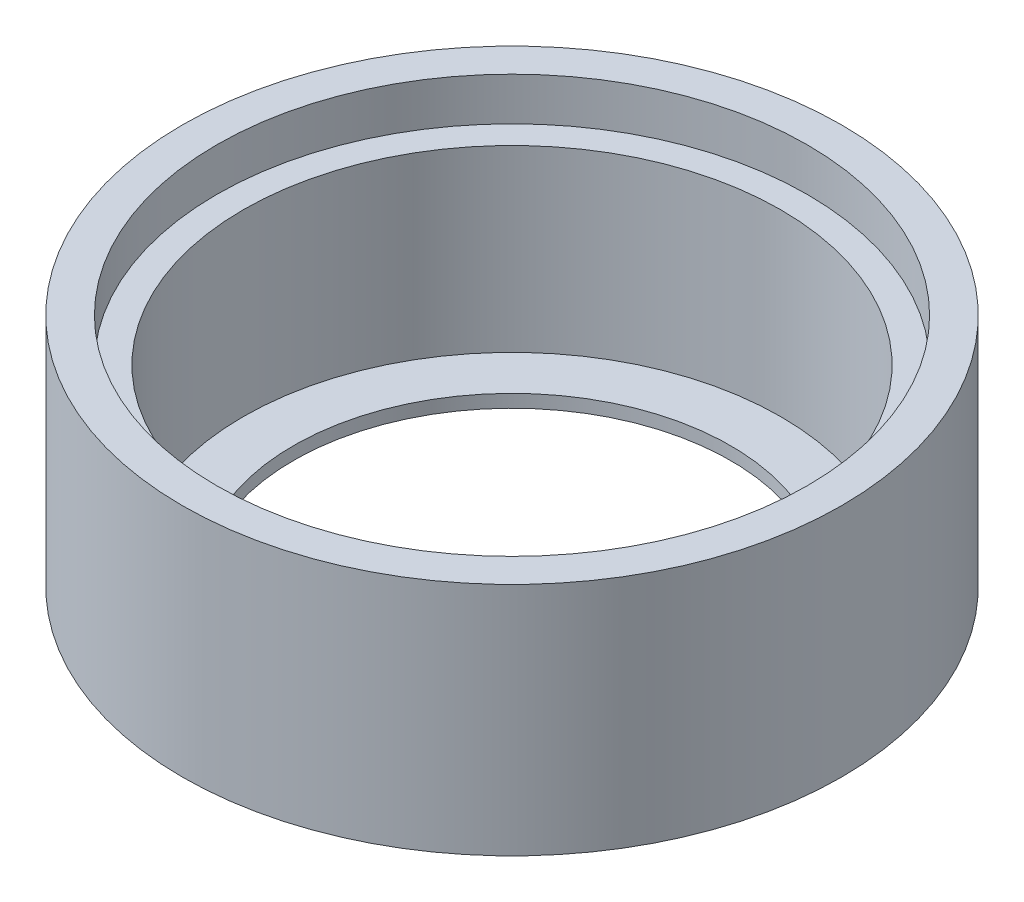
from build123d import *

# Parameters (mm, degrees)
SKETCH1_R           = 5.842
BOSS_EXTRUDE1_DEPTH = 4.1656
SKETCH2_R           = 5.2324
CUT_EXTRUDE1_DEPTH  = 0.762
SKETCH3_R           = 4.7625
CUT_EXTRUDE2_DEPTH  = 3.175
SKETCH4_R           = 3.8735
CUT_EXTRUDE3_DEPTH  = 3.175


with BuildPart() as part:
    # Sketch1 → Boss-Extrude1 (new body)
    with BuildSketch(Plane(origin=(0, 0, 0), x_dir=(1, 0, 0), z_dir=(0, 1, 0))):
        with Locations(Location((0, 0, 0), (0, 0, 270))):
            Circle(SKETCH1_R)
    extrude(amount=BOSS_EXTRUDE1_DEPTH)

    # Sketch2 → Cut-Extrude1 (cut)
    with BuildSketch(Plane(origin=(0, 4.1656, 0), x_dir=(1, 0, 0), z_dir=(0, 1, 0))):
        with Locations(Location((0, 0, 0), (0, 0, 270))):
            Circle(SKETCH2_R)
    extrude(amount=-CUT_EXTRUDE1_DEPTH, mode=Mode.SUBTRACT)

    # Sketch3 → Cut-Extrude2 (cut)
    with BuildSketch(Plane(origin=(0, 3.4036, 0), x_dir=(-1, 0, 0), z_dir=(0, 1, 0))):
        with Locations(Location((0, 0, 0), (0, 0, 90))):
            Circle(SKETCH3_R)
    extrude(amount=-CUT_EXTRUDE2_DEPTH, mode=Mode.SUBTRACT)

    # Sketch4 → Cut-Extrude3 (cut)
    with BuildSketch(Plane(origin=(0, 0.2286, 0), x_dir=(1, 0, 0), z_dir=(0, 1, 0))):
        with Locations(Location((0, 0, 0), (0, 0, 270))):
            Circle(SKETCH4_R)
    extrude(amount=-CUT_EXTRUDE3_DEPTH, mode=Mode.SUBTRACT)


solid = part.part
